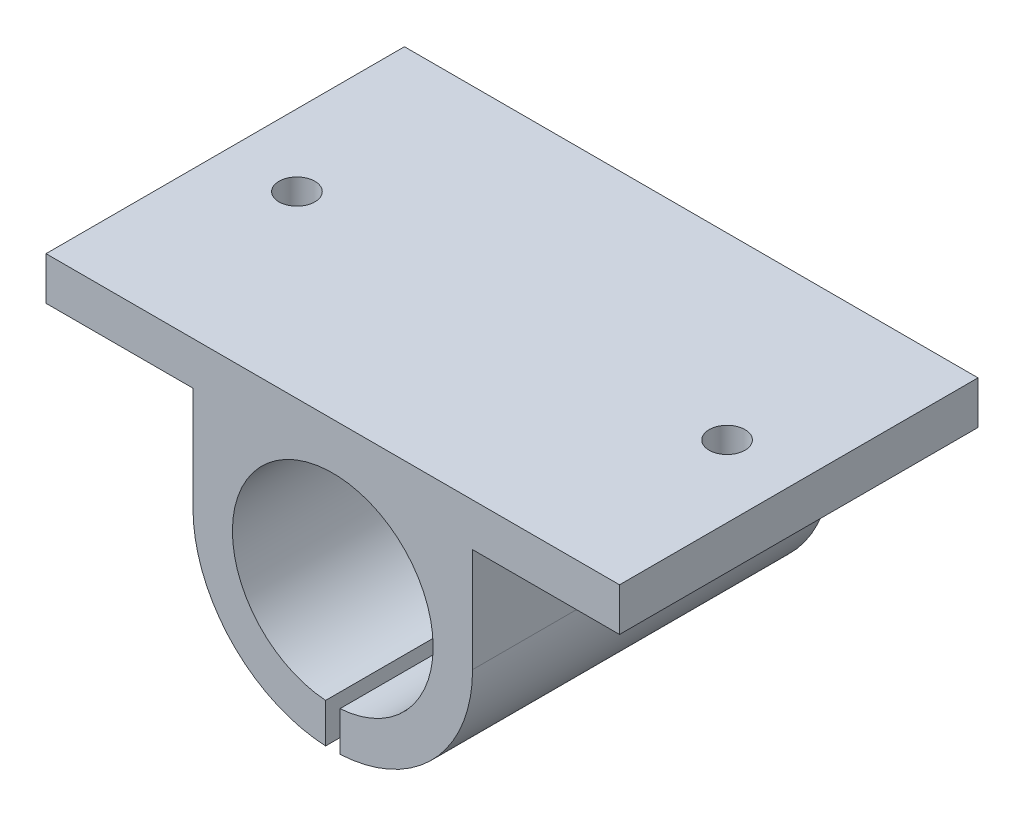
from build123d import *

# Parameters (mm, degrees)
SALIENTE_EXTRUIR1_DEPTH = 25
CROQUIS2_R              = 1.25
CORTAR_EXTRUIR1_DEPTH   = 12


with BuildPart() as part:
    # Croquis1 → Saliente-Extruir1 (new body)
    with BuildSketch(Plane.XY):
        with BuildLine():
            Line((-20, 10.25), (20, 10.25))
            Line((20, 10.25), (20, 7.25))
            Line((20, 7.25), (9.75, 7.25))
            Line((9.75, 7.25), (9.75, 0))
            ThreePointArc((9.75, 0), (7.068857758, -6.715188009), (0.5, -9.737171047))
            Line((0.5, -9.737171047), (0.5, -6.982120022))
            ThreePointArc((0.5, -6.982120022), (0, 7), (-0.5, -6.982120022))
            Line((-0.5, -6.982120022), (-0.5, -9.737171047))
            ThreePointArc((-0.5, -9.737171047), (-7.068857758, -6.715188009), (-9.75, 0))
            Line((-9.75, 0), (-9.75, 7.25))
            Line((-9.75, 7.25), (-20, 7.25))
            Line((-20, 7.25), (-20, 10.25))
        make_face()
    extrude(amount=SALIENTE_EXTRUIR1_DEPTH)

    # Croquis2 → Cortar-Extruir1 (cut)
    with BuildSketch(Plane(origin=(0, 10.25, 0), x_dir=(1, 0, 0), z_dir=(0, 1, 0))):
        with Locations(Location((-15, -12.5, 0), (0, 0, 270))):
            Circle(CROQUIS2_R)
        with Locations(Location((15, -12.5, 0), (0, 0, 270))):
            Circle(CROQUIS2_R)
    extrude(amount=-CORTAR_EXTRUIR1_DEPTH, mode=Mode.SUBTRACT)


solid = part.part
